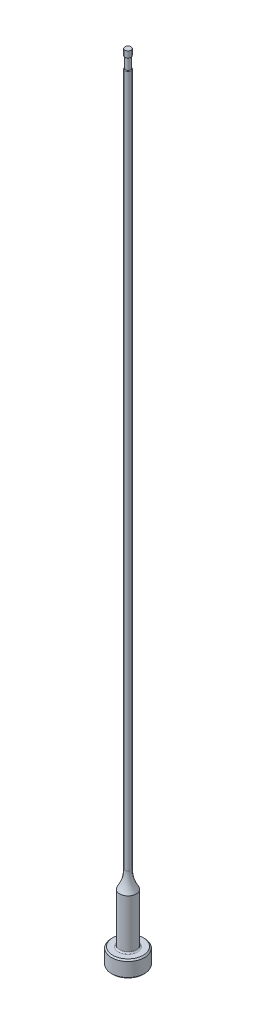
ISO-10303-21;
HEADER;
FILE_DESCRIPTION(('STEP AP214'),'2;1');
FILE_NAME('part.step','',(''),(''),'','','');
FILE_SCHEMA(('AUTOMOTIVE_DESIGN { 1 0 10303 214 1 1 1 1 }'));
ENDSEC;
DATA;
#1=APPLICATION_CONTEXT('core data for automotive mechanical design processes');
#2=APPLICATION_PROTOCOL_DEFINITION('international standard','automotive_design',2000,#1);
#3=PRODUCT_CONTEXT('',#1,'mechanical');
#4=PRODUCT('Part','Part','',(#3));
#5=PRODUCT_RELATED_PRODUCT_CATEGORY('part','',(#4));
#6=PRODUCT_DEFINITION_FORMATION('','',#4);
#7=PRODUCT_DEFINITION_CONTEXT('part definition',#1,'design');
#8=PRODUCT_DEFINITION('design','',#6,#7);
#9=PRODUCT_DEFINITION_SHAPE('','',#8);
#10=(LENGTH_UNIT() NAMED_UNIT(*) SI_UNIT(.MILLI.,.METRE.));
#11=(NAMED_UNIT(*) PLANE_ANGLE_UNIT() SI_UNIT($,.RADIAN.));
#12=(NAMED_UNIT(*) SI_UNIT($,.STERADIAN.) SOLID_ANGLE_UNIT());
#13=UNCERTAINTY_MEASURE_WITH_UNIT(LENGTH_MEASURE(1.E-05),#10,'distance_accuracy_value','');
#14=(GEOMETRIC_REPRESENTATION_CONTEXT(3) GLOBAL_UNCERTAINTY_ASSIGNED_CONTEXT((#13)) GLOBAL_UNIT_ASSIGNED_CONTEXT((#10,
#11,#12)) REPRESENTATION_CONTEXT('',''));
#15=CARTESIAN_POINT('',(0.,0.,0.));
#16=DIRECTION('',(0.,0.,1.));
#17=DIRECTION('',(1.,0.,0.));
#18=AXIS2_PLACEMENT_3D('',#15,#16,#17);
#19=CARTESIAN_POINT('',(0.,259.958771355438,0.));
#20=DIRECTION('',(0.,1.,0.));
#21=DIRECTION('',(0.,0.,1.));
#22=AXIS2_PLACEMENT_3D('',#19,#20,#21);
#23=CYLINDRICAL_SURFACE('',#22,0.594359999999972);
#24=DIRECTION('',(0.,1.,0.));
#25=VECTOR('',#24,1.);
#26=CARTESIAN_POINT('',(-0.492759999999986,259.958771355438,-0.332342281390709));
#27=LINE('',#26,#25);
#28=CARTESIAN_POINT('',(-0.492759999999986,148.973565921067,-0.332342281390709));
#29=VERTEX_POINT('',#28);
#30=CARTESIAN_POINT('',(-0.492759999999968,112.014,-0.332342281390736));
#31=VERTEX_POINT('',#30);
#32=EDGE_CURVE('E66',#29,#31,#27,.F.);
#33=ORIENTED_EDGE('',*,*,#32,.F.);
#34=CARTESIAN_POINT('',(0.,148.973565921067,0.));
#35=DIRECTION('',(0.,1.,0.));
#36=DIRECTION('',(0.,0.,1.));
#37=AXIS2_PLACEMENT_3D('',#34,#35,#36);
#38=CIRCLE('',#37,0.594359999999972);
#39=CARTESIAN_POINT('',(-0.492759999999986,148.973565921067,0.332342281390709));
#40=VERTEX_POINT('',#39);
#41=EDGE_CURVE('E44',#29,#40,#38,.F.);
#42=ORIENTED_EDGE('',*,*,#41,.T.);
#43=DIRECTION('',(0.,1.,0.));
#44=VECTOR('',#43,1.);
#45=CARTESIAN_POINT('',(-0.492759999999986,259.958771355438,0.332342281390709));
#46=LINE('',#45,#44);
#47=CARTESIAN_POINT('',(-0.492759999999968,112.014,0.332342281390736));
#48=VERTEX_POINT('',#47);
#49=EDGE_CURVE('E72',#48,#40,#46,.T.);
#50=ORIENTED_EDGE('',*,*,#49,.F.);
#51=CARTESIAN_POINT('',(-0.492759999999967,112.014,-0.332342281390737));
#52=CARTESIAN_POINT('',(-0.492756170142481,111.975819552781,-0.332315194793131));
#53=CARTESIAN_POINT('',(-0.493448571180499,111.937629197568,-0.331319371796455));
#54=CARTESIAN_POINT('',(-0.496205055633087,111.861285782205,-0.32719484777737));
#55=CARTESIAN_POINT('',(-0.498273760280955,111.823133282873,-0.324058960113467));
#56=CARTESIAN_POINT('',(-0.503877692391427,111.745578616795,-0.315274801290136));
#57=CARTESIAN_POINT('',(-0.507471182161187,111.70619174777,-0.309525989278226));
#58=CARTESIAN_POINT('',(-0.516046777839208,111.628172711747,-0.295012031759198));
#59=CARTESIAN_POINT('',(-0.521026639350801,111.589539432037,-0.286251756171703));
#60=CARTESIAN_POINT('',(-0.532127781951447,111.51413215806,-0.265038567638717));
#61=CARTESIAN_POINT('',(-0.538229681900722,111.477338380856,-0.252646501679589));
#62=CARTESIAN_POINT('',(-0.551257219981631,111.406296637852,-0.222825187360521));
#63=CARTESIAN_POINT('',(-0.55817243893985,111.372024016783,-0.205456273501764));
#64=CARTESIAN_POINT('',(-0.567358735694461,111.329706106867,-0.177255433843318));
#65=CARTESIAN_POINT('',(-0.569648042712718,111.319427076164,-0.169801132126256));
#66=CARTESIAN_POINT('',(-0.574154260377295,111.299625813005,-0.15388318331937));
#67=CARTESIAN_POINT('',(-0.576371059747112,111.29010471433,-0.14541806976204));
#68=CARTESIAN_POINT('',(-0.580650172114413,111.27206685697,-0.127266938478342));
#69=CARTESIAN_POINT('',(-0.582710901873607,111.263559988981,-0.1175705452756));
#70=CARTESIAN_POINT('',(-0.586499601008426,111.248152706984,-0.0969103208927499));
#71=CARTESIAN_POINT('',(-0.588228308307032,111.241248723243,-0.0859493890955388));
#72=CARTESIAN_POINT('',(-0.590708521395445,111.231442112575,-0.0662855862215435));
#73=CARTESIAN_POINT('',(-0.591597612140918,111.22796041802,-0.0578911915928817));
#74=CARTESIAN_POINT('',(-0.593032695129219,111.222365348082,-0.040629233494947));
#75=CARTESIAN_POINT('',(-0.593579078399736,111.220250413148,-0.0317622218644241));
#76=CARTESIAN_POINT('',(-0.594270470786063,111.217577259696,-0.0137206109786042));
#77=CARTESIAN_POINT('',(-0.594413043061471,111.217028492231,-0.00454448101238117));
#78=CARTESIAN_POINT('',(-0.59427126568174,111.217575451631,0.0137560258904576));
#79=CARTESIAN_POINT('',(-0.593986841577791,111.218671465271,0.022880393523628));
#80=CARTESIAN_POINT('',(-0.593063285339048,111.222250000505,0.0401088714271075));
#81=CARTESIAN_POINT('',(-0.592452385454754,111.224622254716,0.048238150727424));
#82=CARTESIAN_POINT('',(-0.590952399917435,111.230489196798,0.0640487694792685));
#83=CARTESIAN_POINT('',(-0.590063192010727,111.23398437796,0.0717299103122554));
#84=CARTESIAN_POINT('',(-0.587497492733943,111.244163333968,0.0908266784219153));
#85=CARTESIAN_POINT('',(-0.585661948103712,111.251526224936,0.101857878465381));
#86=CARTESIAN_POINT('',(-0.581672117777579,111.267837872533,0.122611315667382));
#87=CARTESIAN_POINT('',(-0.579516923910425,111.27679116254,0.132329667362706));
#88=CARTESIAN_POINT('',(-0.573410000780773,111.302730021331,0.157262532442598));
#89=CARTESIAN_POINT('',(-0.569297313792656,111.320800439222,0.171297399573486));
#90=CARTESIAN_POINT('',(-0.561050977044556,111.358739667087,0.196626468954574));
#91=CARTESIAN_POINT('',(-0.55691730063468,111.378613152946,0.20791324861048));
#92=CARTESIAN_POINT('',(-0.548723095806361,111.420118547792,0.22868113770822));
#93=CARTESIAN_POINT('',(-0.544669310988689,111.44178661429,0.238091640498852));
#94=CARTESIAN_POINT('',(-0.536909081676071,111.485888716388,0.255105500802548));
#95=CARTESIAN_POINT('',(-0.533203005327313,111.50832353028,0.262706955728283));
#96=CARTESIAN_POINT('',(-0.522705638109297,111.576539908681,0.283349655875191));
#97=CARTESIAN_POINT('',(-0.516562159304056,111.623099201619,0.29416845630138));
#98=CARTESIAN_POINT('',(-0.508338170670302,111.698558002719,0.308040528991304));
#99=CARTESIAN_POINT('',(-0.505611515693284,111.727164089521,0.312472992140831));
#100=CARTESIAN_POINT('',(-0.50092453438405,111.784636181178,0.319935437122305));
#101=CARTESIAN_POINT('',(-0.498964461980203,111.813502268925,0.32296495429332));
#102=CARTESIAN_POINT('',(-0.495855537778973,111.870951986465,0.327718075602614));
#103=CARTESIAN_POINT('',(-0.494695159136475,111.899533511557,0.329460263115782));
#104=CARTESIAN_POINT('',(-0.493147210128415,111.956743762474,0.331767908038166));
#105=CARTESIAN_POINT('',(-0.492759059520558,111.985372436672,0.332334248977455));
#106=CARTESIAN_POINT('',(-0.492759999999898,112.013999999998,0.332342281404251));
#107=B_SPLINE_CURVE_WITH_KNOTS('',3,(#51,#52,#53,#54,#55,#56,#57,#58,#59,#60,#61,#62,#63,#64,
#65,#66,#67,#68,#69,#70,#71,#72,#73,#74,#75,#76,#77,#78,#79,#80,#81,#82,#83,#84,#85,#86,#87,#88,
#89,#90,#91,#92,#93,#94,#95,#96,#97,#98,#99,#100,#101,#102,#103,#104,#105,#106),.UNSPECIFIED.,
.F.,.F.,(4,2,2,2,2,2,2,2,2,2,2,2,2,2,2,2,2,2,2,2,2,2,2,2,2,2,2,4),(0.,0.114538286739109,
0.229463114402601,0.349243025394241,0.468830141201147,0.586518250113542,0.702835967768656,
0.741495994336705,0.780212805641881,0.819280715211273,0.85826076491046,0.885552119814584,
0.912812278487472,0.940236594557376,0.967665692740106,0.993035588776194,1.01841664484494,
1.05835278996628,1.09840465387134,1.16775387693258,1.23728838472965,1.30908278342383,
1.38095235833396,1.52513678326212,1.61233352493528,1.69955912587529,1.78549956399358,
1.87137540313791),.UNSPECIFIED.);
#108=EDGE_CURVE('E74',#31,#48,#107,.T.);
#109=ORIENTED_EDGE('',*,*,#108,.F.);
#110=EDGE_LOOP('',(#33,#42,#50,#109));
#111=FACE_BOUND('',#110,.T.);
#112=CARTESIAN_POINT('',(0.,16.1097728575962,0.));
#113=DIRECTION('',(0.,1.,0.));
#114=DIRECTION('',(0.,0.,1.));
#115=AXIS2_PLACEMENT_3D('',#112,#113,#114);
#116=CIRCLE('',#115,0.594359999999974);
#117=CARTESIAN_POINT('',(0.,16.1097728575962,0.594359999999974));
#118=VERTEX_POINT('',#117);
#119=EDGE_CURVE('E95',#118,#118,#116,.T.);
#120=ORIENTED_EDGE('',*,*,#119,.T.);
#121=EDGE_LOOP('',(#120));
#122=FACE_BOUND('',#121,.T.);
#123=ADVANCED_FACE('F36',(#111,#122),#23,.T.);
#124=CARTESIAN_POINT('',(0.,16.1097728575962,0.));
#125=DIRECTION('',(0.,1.,0.));
#126=DIRECTION('',(0.,0.,1.));
#127=AXIS2_PLACEMENT_3D('',#124,#125,#126);
#128=TOROIDAL_SURFACE('',#127,6.94435999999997,6.35);
#129=CARTESIAN_POINT('',(0.,12.7,0.));
#130=DIRECTION('',(0.,1.,0.));
#131=DIRECTION('',(0.,0.,1.));
#132=AXIS2_PLACEMENT_3D('',#129,#130,#131);
#133=CIRCLE('',#132,1.58749999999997);
#134=CARTESIAN_POINT('',(0.,12.7,1.58749999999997));
#135=VERTEX_POINT('',#134);
#136=EDGE_CURVE('E92',#135,#135,#133,.T.);
#137=ORIENTED_EDGE('',*,*,#136,.T.);
#138=EDGE_LOOP('',(#137));
#139=FACE_BOUND('',#138,.T.);
#140=ORIENTED_EDGE('',*,*,#119,.F.);
#141=EDGE_LOOP('',(#140));
#142=FACE_BOUND('',#141,.T.);
#143=ADVANCED_FACE('F156',(#139,#142),#128,.F.);
#144=CARTESIAN_POINT('',(0.,259.958771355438,0.));
#145=DIRECTION('',(0.,1.,0.));
#146=DIRECTION('',(0.,0.,1.));
#147=AXIS2_PLACEMENT_3D('',#144,#145,#146);
#148=CYLINDRICAL_SURFACE('',#147,1.58749999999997);
#149=CARTESIAN_POINT('',(0.,3.42900000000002,0.));
#150=DIRECTION('',(0.,1.,0.));
#151=DIRECTION('',(0.,0.,1.));
#152=AXIS2_PLACEMENT_3D('',#149,#150,#151);
#153=CIRCLE('',#152,1.58749999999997);
#154=CARTESIAN_POINT('',(0.,3.42900000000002,1.58749999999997));
#155=VERTEX_POINT('',#154);
#156=EDGE_CURVE('E110',#155,#155,#153,.T.);
#157=ORIENTED_EDGE('',*,*,#156,.T.);
#158=EDGE_LOOP('',(#157));
#159=FACE_BOUND('',#158,.T.);
#160=ORIENTED_EDGE('',*,*,#136,.F.);
#161=EDGE_LOOP('',(#160));
#162=FACE_BOUND('',#161,.T.);
#163=ADVANCED_FACE('F153',(#159,#162),#148,.T.);
#164=CARTESIAN_POINT('',(-3.17499999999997,3.175,0.));
#165=DIRECTION('',(0.,1.,0.));
#166=DIRECTION('',(0.,0.,1.));
#167=AXIS2_PLACEMENT_3D('',#164,#165,#166);
#168=PLANE('',#167);
#169=CARTESIAN_POINT('',(0.,3.175,0.));
#170=DIRECTION('',(0.,1.,0.));
#171=DIRECTION('',(0.,0.,1.));
#172=AXIS2_PLACEMENT_3D('',#169,#170,#171);
#173=CIRCLE('',#172,1.84149999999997);
#174=CARTESIAN_POINT('',(0.,3.175,1.84149999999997));
#175=VERTEX_POINT('',#174);
#176=EDGE_CURVE('E78',#175,#175,#173,.F.);
#177=ORIENTED_EDGE('',*,*,#176,.T.);
#178=EDGE_LOOP('',(#177));
#179=FACE_BOUND('',#178,.T.);
#180=CARTESIAN_POINT('',(0.,3.175,0.));
#181=DIRECTION('',(0.,1.,0.));
#182=DIRECTION('',(0.,0.,1.));
#183=AXIS2_PLACEMENT_3D('',#180,#181,#182);
#184=CIRCLE('',#183,2.92099999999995);
#185=CARTESIAN_POINT('',(0.,3.175,2.92099999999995));
#186=VERTEX_POINT('',#185);
#187=EDGE_CURVE('E98',#186,#186,#184,.T.);
#188=ORIENTED_EDGE('',*,*,#187,.T.);
#189=EDGE_LOOP('',(#188));
#190=FACE_BOUND('',#189,.T.);
#191=ADVANCED_FACE('F149',(#179,#190),#168,.T.);
#192=CARTESIAN_POINT('',(0.,259.958771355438,0.));
#193=DIRECTION('',(0.,1.,0.));
#194=DIRECTION('',(0.,0.,1.));
#195=AXIS2_PLACEMENT_3D('',#192,#193,#194);
#196=CYLINDRICAL_SURFACE('',#195,3.17499999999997);
#197=CARTESIAN_POINT('',(0.,2.92100000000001,0.));
#198=DIRECTION('',(0.,1.,0.));
#199=DIRECTION('',(0.,0.,1.));
#200=AXIS2_PLACEMENT_3D('',#197,#198,#199);
#201=CIRCLE('',#200,3.17499999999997);
#202=CARTESIAN_POINT('',(0.,2.92100000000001,3.17499999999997));
#203=VERTEX_POINT('',#202);
#204=EDGE_CURVE('E104',#203,#203,#201,.F.);
#205=ORIENTED_EDGE('',*,*,#204,.T.);
#206=EDGE_LOOP('',(#205));
#207=FACE_BOUND('',#206,.T.);
#208=CARTESIAN_POINT('',(0.,0.254000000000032,0.));
#209=DIRECTION('',(0.,-1.,0.));
#210=DIRECTION('',(0.,0.,-1.));
#211=AXIS2_PLACEMENT_3D('',#208,#209,#210);
#212=CIRCLE('',#211,3.17499999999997);
#213=CARTESIAN_POINT('',(0.,0.254000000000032,-3.17499999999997));
#214=VERTEX_POINT('',#213);
#215=EDGE_CURVE('E101',#214,#214,#212,.F.);
#216=ORIENTED_EDGE('',*,*,#215,.T.);
#217=EDGE_LOOP('',(#216));
#218=FACE_BOUND('',#217,.T.);
#219=ADVANCED_FACE('F145',(#207,#218),#196,.T.);
#220=CARTESIAN_POINT('',(0.,0.,0.));
#221=DIRECTION('',(0.,-1.,0.));
#222=DIRECTION('',(0.,0.,-1.));
#223=AXIS2_PLACEMENT_3D('',#220,#221,#222);
#224=PLANE('',#223);
#225=CARTESIAN_POINT('',(0.,0.,0.));
#226=DIRECTION('',(0.,-1.,0.));
#227=DIRECTION('',(0.,0.,-1.));
#228=AXIS2_PLACEMENT_3D('',#225,#226,#227);
#229=CIRCLE('',#228,2.92099999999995);
#230=CARTESIAN_POINT('',(0.,0.,-2.92099999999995));
#231=VERTEX_POINT('',#230);
#232=EDGE_CURVE('E107',#231,#231,#229,.T.);
#233=ORIENTED_EDGE('',*,*,#232,.T.);
#234=EDGE_LOOP('',(#233));
#235=FACE_BOUND('',#234,.T.);
#236=ADVANCED_FACE('F141',(#235),#224,.T.);
#237=CARTESIAN_POINT('',(0.,3.17499999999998,0.));
#238=DIRECTION('',(0.,-1.,0.));
#239=DIRECTION('',(0.,0.,-1.));
#240=AXIS2_PLACEMENT_3D('',#237,#238,#239);
#241=CONICAL_SURFACE('',#240,2.92099999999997,0.7853981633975);
#242=ORIENTED_EDGE('',*,*,#204,.F.);
#243=EDGE_LOOP('',(#242));
#244=FACE_BOUND('',#243,.T.);
#245=ORIENTED_EDGE('',*,*,#187,.F.);
#246=EDGE_LOOP('',(#245));
#247=FACE_BOUND('',#246,.T.);
#248=ADVANCED_FACE('F144',(#244,#247),#241,.T.);
#249=CARTESIAN_POINT('',(0.,0.254000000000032,0.));
#250=DIRECTION('',(0.,1.,0.));
#251=DIRECTION('',(0.,0.,1.));
#252=AXIS2_PLACEMENT_3D('',#249,#250,#251);
#253=CONICAL_SURFACE('',#252,3.17499999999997,0.785398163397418);
#254=ORIENTED_EDGE('',*,*,#232,.F.);
#255=EDGE_LOOP('',(#254));
#256=FACE_BOUND('',#255,.T.);
#257=ORIENTED_EDGE('',*,*,#215,.F.);
#258=EDGE_LOOP('',(#257));
#259=FACE_BOUND('',#258,.T.);
#260=ADVANCED_FACE('F245',(#256,#259),#253,.T.);
#261=CARTESIAN_POINT('',(0.,3.42900000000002,0.));
#262=DIRECTION('',(0.,1.,0.));
#263=DIRECTION('',(0.,0.,1.));
#264=AXIS2_PLACEMENT_3D('',#261,#262,#263);
#265=TOROIDAL_SURFACE('',#264,1.84149999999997,0.254);
#266=ORIENTED_EDGE('',*,*,#176,.F.);
#267=EDGE_LOOP('',(#266));
#268=FACE_BOUND('',#267,.T.);
#269=ORIENTED_EDGE('',*,*,#156,.F.);
#270=EDGE_LOOP('',(#269));
#271=FACE_BOUND('',#270,.T.);
#272=ADVANCED_FACE('F139',(#268,#271),#265,.F.);
#273=CARTESIAN_POINT('',(0.,153.448281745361,0.));
#274=DIRECTION('',(0.,1.,0.));
#275=DIRECTION('',(0.,0.,1.));
#276=AXIS2_PLACEMENT_3D('',#273,#274,#275);
#277=CYLINDRICAL_SURFACE('',#276,0.492759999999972);
#278=CARTESIAN_POINT('',(0.,151.13,0.));
#279=DIRECTION('',(0.,1.,0.));
#280=DIRECTION('',(0.,0.,1.));
#281=AXIS2_PLACEMENT_3D('',#278,#279,#280);
#282=CIRCLE('',#281,0.492759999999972);
#283=CARTESIAN_POINT('',(0.,151.13,0.492759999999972));
#284=VERTEX_POINT('',#283);
#285=EDGE_CURVE('E71',#284,#284,#282,.T.);
#286=ORIENTED_EDGE('',*,*,#285,.F.);
#287=EDGE_LOOP('',(#286));
#288=FACE_BOUND('',#287,.T.);
#289=CARTESIAN_POINT('',(0.,149.098,0.));
#290=DIRECTION('',(0.,1.,0.));
#291=DIRECTION('',(0.,0.,1.));
#292=AXIS2_PLACEMENT_3D('',#289,#290,#291);
#293=CIRCLE('',#292,0.492759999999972);
#294=CARTESIAN_POINT('',(-0.492759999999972,149.098,0.));
#295=VERTEX_POINT('',#294);
#296=EDGE_CURVE('E89',#295,#295,#293,.T.);
#297=ORIENTED_EDGE('',*,*,#296,.T.);
#298=EDGE_LOOP('',(#297));
#299=FACE_BOUND('',#298,.T.);
#300=ADVANCED_FACE('F136',(#288,#299),#277,.T.);
#301=CARTESIAN_POINT('',(-0.492759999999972,150.114,-3.17499999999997));
#302=DIRECTION('',(1.,0.,0.));
#303=DIRECTION('',(0.,1.,0.));
#304=AXIS2_PLACEMENT_3D('',#301,#302,#303);
#305=PLANE('',#304);
#306=CARTESIAN_POINT('',(-0.492759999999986,148.973565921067,0.332342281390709));
#307=CARTESIAN_POINT('',(-0.492759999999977,148.97845108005,0.332357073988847));
#308=CARTESIAN_POINT('',(-0.492759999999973,148.983318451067,0.331839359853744));
#309=CARTESIAN_POINT('',(-0.492759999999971,148.992805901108,0.329871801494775));
#310=CARTESIAN_POINT('',(-0.492759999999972,148.997428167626,0.328432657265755));
#311=CARTESIAN_POINT('',(-0.492759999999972,149.006313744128,0.324757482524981));
#312=CARTESIAN_POINT('',(-0.492759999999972,149.010578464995,0.322524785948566));
#313=CARTESIAN_POINT('',(-0.492759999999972,149.018714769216,0.317418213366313));
#314=CARTESIAN_POINT('',(-0.492759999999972,149.022585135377,0.314542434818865));
#315=CARTESIAN_POINT('',(-0.492759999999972,149.031640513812,0.306816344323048));
#316=CARTESIAN_POINT('',(-0.492759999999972,149.036577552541,0.301676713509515));
#317=CARTESIAN_POINT('',(-0.492759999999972,149.045587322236,0.290701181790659));
#318=CARTESIAN_POINT('',(-0.492759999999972,149.049658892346,0.284864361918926));
#319=CARTESIAN_POINT('',(-0.492759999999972,149.059607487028,0.268553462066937));
#320=CARTESIAN_POINT('',(-0.492759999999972,149.064790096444,0.257660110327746));
#321=CARTESIAN_POINT('',(-0.492759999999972,149.073580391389,0.235187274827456));
#322=CARTESIAN_POINT('',(-0.492759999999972,149.077173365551,0.223602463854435));
#323=CARTESIAN_POINT('',(-0.492759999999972,149.084704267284,0.194167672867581));
#324=CARTESIAN_POINT('',(-0.492759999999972,149.087886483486,0.176130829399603));
#325=CARTESIAN_POINT('',(-0.492759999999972,149.092644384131,0.139809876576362));
#326=CARTESIAN_POINT('',(-0.492759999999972,149.094213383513,0.121525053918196));
#327=CARTESIAN_POINT('',(-0.492759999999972,149.096380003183,0.0859638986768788));
#328=CARTESIAN_POINT('',(-0.492759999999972,149.09702849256,0.0686903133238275));
#329=CARTESIAN_POINT('',(-0.492759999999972,149.097816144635,0.0342749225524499));
#330=CARTESIAN_POINT('',(-0.492759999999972,149.097959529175,0.0171332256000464));
#331=CARTESIAN_POINT('',(-0.492759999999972,149.098,0.));
#332=B_SPLINE_CURVE_WITH_KNOTS('',3,(#306,#307,#308,#309,#310,#311,#312,#313,#314,#315,#316,
#317,#318,#319,#320,#321,#322,#323,#324,#325,#326,#327,#328,#329,#330,#331),.UNSPECIFIED.,.F.,
.F.,(4,2,2,2,2,2,2,2,2,2,2,2,4),(0.,0.0145999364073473,0.0290333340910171,0.0434067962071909,
0.0578233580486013,0.0790827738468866,0.100370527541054,0.13635634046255,0.172668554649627,
0.227468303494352,0.282494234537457,0.334342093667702,0.385755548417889),.UNSPECIFIED.);
#333=EDGE_CURVE('E77',#40,#295,#332,.T.);
#334=ORIENTED_EDGE('',*,*,#333,.T.);
#335=CARTESIAN_POINT('',(-0.492759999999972,149.098,0.));
#336=CARTESIAN_POINT('',(-0.492759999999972,149.097956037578,-0.0174712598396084));
#337=CARTESIAN_POINT('',(-0.492759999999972,149.097808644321,-0.0349524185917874));
#338=CARTESIAN_POINT('',(-0.492759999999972,149.096987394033,-0.0700519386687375));
#339=CARTESIAN_POINT('',(-0.492759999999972,149.096308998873,-0.0876701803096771));
#340=CARTESIAN_POINT('',(-0.492759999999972,149.094066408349,-0.123326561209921));
#341=CARTESIAN_POINT('',(-0.492759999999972,149.092479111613,-0.141363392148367));
#342=CARTESIAN_POINT('',(-0.492759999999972,149.087706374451,-0.177190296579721));
#343=CARTESIAN_POINT('',(-0.492759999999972,149.084527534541,-0.194981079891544));
#344=CARTESIAN_POINT('',(-0.492759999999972,149.077991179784,-0.220348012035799));
#345=CARTESIAN_POINT('',(-0.492759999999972,149.075682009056,-0.228189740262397));
#346=CARTESIAN_POINT('',(-0.492759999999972,149.070387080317,-0.243637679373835));
#347=CARTESIAN_POINT('',(-0.492759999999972,149.067402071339,-0.251244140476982));
#348=CARTESIAN_POINT('',(-0.492759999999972,149.060570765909,-0.266152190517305));
#349=CARTESIAN_POINT('',(-0.492759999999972,149.056716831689,-0.273450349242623));
#350=CARTESIAN_POINT('',(-0.492759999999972,149.047983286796,-0.287413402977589));
#351=CARTESIAN_POINT('',(-0.492759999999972,149.043105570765,-0.294079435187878));
#352=CARTESIAN_POINT('',(-0.492759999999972,149.034143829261,-0.304142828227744));
#353=CARTESIAN_POINT('',(-0.492759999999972,149.030410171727,-0.307850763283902));
#354=CARTESIAN_POINT('',(-0.492759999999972,149.022437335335,-0.314683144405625));
#355=CARTESIAN_POINT('',(-0.492759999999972,149.018198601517,-0.317808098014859));
#356=CARTESIAN_POINT('',(-0.492759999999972,149.009908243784,-0.322875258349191));
#357=CARTESIAN_POINT('',(-0.492759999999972,149.005922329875,-0.324924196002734));
#358=CARTESIAN_POINT('',(-0.492759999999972,148.997667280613,-0.328328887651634));
#359=CARTESIAN_POINT('',(-0.492759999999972,148.993398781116,-0.329686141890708));
#360=CARTESIAN_POINT('',(-0.492759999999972,148.986507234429,-0.331205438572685));
#361=CARTESIAN_POINT('',(-0.492759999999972,148.983940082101,-0.33162986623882));
#362=CARTESIAN_POINT('',(-0.492759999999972,148.978771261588,-0.332199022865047));
#363=CARTESIAN_POINT('',(-0.492759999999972,148.976169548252,-0.33234334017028));
#364=CARTESIAN_POINT('',(-0.492759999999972,148.973565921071,-0.332342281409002));
#365=B_SPLINE_CURVE_WITH_KNOTS('',3,(#335,#336,#337,#338,#339,#340,#341,#342,#343,#344,#345,
#346,#347,#348,#349,#350,#351,#352,#353,#354,#355,#356,#357,#358,#359,#360,#361,#362,#363,#364),
.UNSPECIFIED.,.F.,.F.,(4,2,2,2,2,2,2,2,2,2,2,2,2,2,4),(0.,0.0524301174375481,0.10531327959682,
0.159604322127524,0.21367204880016,0.238172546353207,0.262646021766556,0.287343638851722,
0.311995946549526,0.32773774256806,0.343465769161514,0.356857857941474,0.37022077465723,
0.378012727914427,0.385816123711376),.UNSPECIFIED.);
#366=EDGE_CURVE('E58',#295,#29,#365,.T.);
#367=ORIENTED_EDGE('',*,*,#366,.T.);
#368=ORIENTED_EDGE('',*,*,#32,.T.);
#369=DIRECTION('',(0.,0.,1.));
#370=VECTOR('',#369,1.);
#371=CARTESIAN_POINT('',(-0.492759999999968,112.014,-3.17499999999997));
#372=LINE('',#371,#370);
#373=EDGE_CURVE('E70',#31,#48,#372,.T.);
#374=ORIENTED_EDGE('',*,*,#373,.T.);
#375=ORIENTED_EDGE('',*,*,#49,.T.);
#376=EDGE_LOOP('',(#334,#367,#368,#374,#375));
#377=FACE_BOUND('',#376,.T.);
#378=ADVANCED_FACE('F68',(#377),#305,.F.);
#379=CARTESIAN_POINT('',(-3.66775999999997,112.014,-3.17499999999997));
#380=DIRECTION('',(0.,0.,1.));
#381=DIRECTION('',(1.,0.,0.));
#382=AXIS2_PLACEMENT_3D('',#379,#380,#381);
#383=CYLINDRICAL_SURFACE('',#382,3.175);
#384=ORIENTED_EDGE('',*,*,#373,.F.);
#385=ORIENTED_EDGE('',*,*,#108,.T.);
#386=EDGE_LOOP('',(#384,#385));
#387=FACE_BOUND('',#386,.T.);
#388=ADVANCED_FACE('F80',(#387),#383,.F.);
#389=CARTESIAN_POINT('',(0.,152.687735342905,0.));
#390=DIRECTION('',(0.,1.,0.));
#391=DIRECTION('',(0.,0.,1.));
#392=AXIS2_PLACEMENT_3D('',#389,#390,#391);
#393=CYLINDRICAL_SURFACE('',#392,0.581659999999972);
#394=CARTESIAN_POINT('',(0.,151.25115027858,0.));
#395=DIRECTION('',(0.,-1.,0.));
#396=DIRECTION('',(0.,0.,-1.));
#397=AXIS2_PLACEMENT_3D('',#394,#395,#396);
#398=CIRCLE('',#397,0.581659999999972);
#399=CARTESIAN_POINT('',(0.,151.25115027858,-0.581659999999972));
#400=VERTEX_POINT('',#399);
#401=EDGE_CURVE('E11',#400,#400,#398,.F.);
#402=ORIENTED_EDGE('',*,*,#401,.T.);
#403=EDGE_LOOP('',(#402));
#404=FACE_BOUND('',#403,.T.);
#405=CARTESIAN_POINT('',(0.,152.4,0.));
#406=DIRECTION('',(0.,1.,0.));
#407=DIRECTION('',(0.,0.,1.));
#408=AXIS2_PLACEMENT_3D('',#405,#406,#407);
#409=CIRCLE('',#408,0.581659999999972);
#410=CARTESIAN_POINT('',(0.,152.4,0.581659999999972));
#411=VERTEX_POINT('',#410);
#412=EDGE_CURVE('E81',#411,#411,#409,.T.);
#413=ORIENTED_EDGE('',*,*,#412,.F.);
#414=EDGE_LOOP('',(#413));
#415=FACE_BOUND('',#414,.T.);
#416=ADVANCED_FACE('F133',(#404,#415),#393,.T.);
#417=CARTESIAN_POINT('',(-0.59435999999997,152.4,0.));
#418=DIRECTION('',(0.,1.,0.));
#419=DIRECTION('',(0.,0.,1.));
#420=AXIS2_PLACEMENT_3D('',#417,#418,#419);
#421=PLANE('',#420);
#422=ORIENTED_EDGE('',*,*,#412,.T.);
#423=EDGE_LOOP('',(#422));
#424=FACE_BOUND('',#423,.T.);
#425=ADVANCED_FACE('F177',(#424),#421,.T.);
#426=CARTESIAN_POINT('',(0.,148.973565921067,0.));
#427=DIRECTION('',(0.,1.,0.));
#428=DIRECTION('',(0.,0.,1.));
#429=AXIS2_PLACEMENT_3D('',#426,#427,#428);
#430=TOROIDAL_SURFACE('',#429,0.467359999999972,0.127);
#431=ORIENTED_EDGE('',*,*,#333,.F.);
#432=ORIENTED_EDGE('',*,*,#41,.F.);
#433=ORIENTED_EDGE('',*,*,#366,.F.);
#434=ORIENTED_EDGE('',*,*,#296,.F.);
#435=EDGE_LOOP('',(#431,#432,#433,#434));
#436=FACE_BOUND('',#435,.T.);
#437=ADVANCED_FACE('F209',(#436),#430,.T.);
#438=CARTESIAN_POINT('',(0.,151.25115027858,0.));
#439=DIRECTION('',(0.,-1.,0.));
#440=DIRECTION('',(0.,0.,-1.));
#441=AXIS2_PLACEMENT_3D('',#438,#439,#440);
#442=TOROIDAL_SURFACE('',#441,0.454659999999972,0.127);
#443=ORIENTED_EDGE('',*,*,#285,.T.);
#444=EDGE_LOOP('',(#443));
#445=FACE_BOUND('',#444,.T.);
#446=ORIENTED_EDGE('',*,*,#401,.F.);
#447=EDGE_LOOP('',(#446));
#448=FACE_BOUND('',#447,.T.);
#449=ADVANCED_FACE('F38',(#445,#448),#442,.T.);
#450=CLOSED_SHELL('',(#123,#143,#163,#191,#219,#236,#248,#260,#272,#300,#378,#388,#416,#425,
#437,#449));
#451=MANIFOLD_SOLID_BREP('B2',#450);
#452=ADVANCED_BREP_SHAPE_REPRESENTATION('',(#18,#451),#14);
#453=SHAPE_DEFINITION_REPRESENTATION(#9,#452);
ENDSEC;
END-ISO-10303-21;
